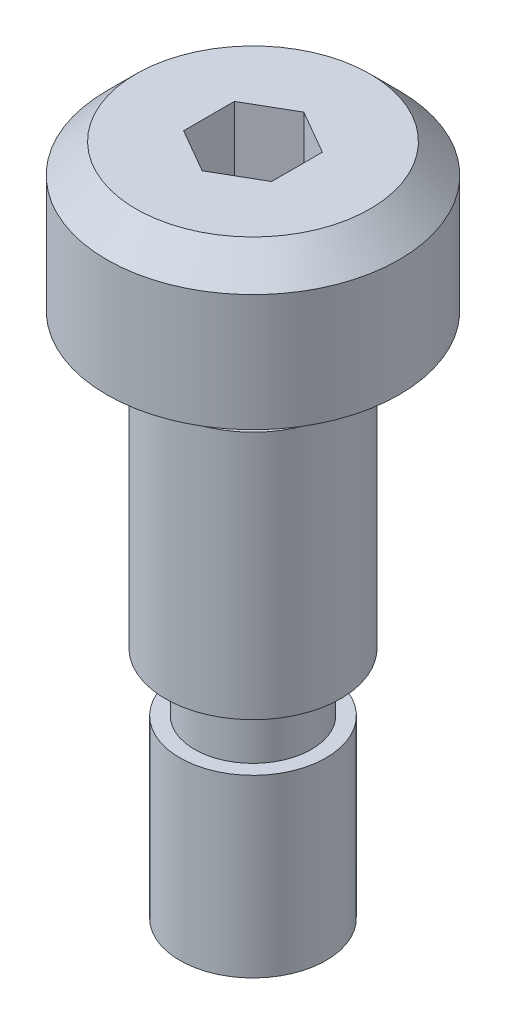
from build123d import *

# Parameters (mm, degrees)
CUT_EXTRUDE1_DEPTH = 3.581396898


with BuildPart() as part:
    # Sketch2 → Base-Revolve (revolve)
    with BuildSketch(Plane.XY, mode=Mode.PRIVATE) as base_revolve_sk:
        Polygon((0, 0), (7.9375, 0), (7.9375, 6.35), (6.35, 7.9375), (0, 7.9375), align=None)
    revolve(base_revolve_sk.sketch.rotate(Axis((0, 0, 0), (0, 1, 0)), 90), axis=Axis((0, 0, 0), (0, 1, 0)))

    # Sketch3 → Boss-Revolve1 (revolve)
    with BuildSketch(Plane.XY, mode=Mode.PRIVATE) as boss_revolve1_sk:
        Polygon((0, -28.575), (3.96875, -28.575), (3.96875, -19.05), (3.175, -19.05), (3.175, -15.875), (4.7625, -15.875), (4.7625, -2.362197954), (4.445, -2.362197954), (4.445, 0), (0, 0), align=None)
    revolve(boss_revolve1_sk.sketch.rotate(Axis((0, 0, 0), (0, 1, 0)), 90), axis=Axis((0, 0, 0), (0, 1, 0)))

    # Sketch4 → Cut-Extrude1 (cut)
    with BuildSketch(Plane(origin=(0, 7.9375, 0), x_dir=(-1, 0, 0), z_dir=(0, 1, 0))):
        Polygon((2.387597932, 1.378480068), (6.25e-07, 2.756960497), (-2.387597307, 1.378481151), (-2.387598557, -1.378478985), (-1.876e-06, -2.756960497), (2.387596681, -1.378482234), align=None)
    extrude(amount=-CUT_EXTRUDE1_DEPTH, mode=Mode.SUBTRACT)


solid = part.part
